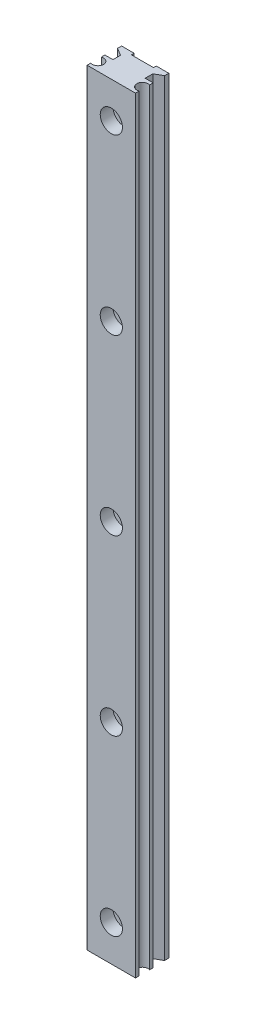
ISO-10303-21;
HEADER;
FILE_DESCRIPTION(('STEP AP214'),'2;1');
FILE_NAME('part.step','',(''),(''),'','','');
FILE_SCHEMA(('AUTOMOTIVE_DESIGN { 1 0 10303 214 1 1 1 1 }'));
ENDSEC;
DATA;
#1=APPLICATION_CONTEXT('core data for automotive mechanical design processes');
#2=APPLICATION_PROTOCOL_DEFINITION('international standard','automotive_design',2000,#1);
#3=PRODUCT_CONTEXT('',#1,'mechanical');
#4=PRODUCT('Part','Part','',(#3));
#5=PRODUCT_RELATED_PRODUCT_CATEGORY('part','',(#4));
#6=PRODUCT_DEFINITION_FORMATION('','',#4);
#7=PRODUCT_DEFINITION_CONTEXT('part definition',#1,'design');
#8=PRODUCT_DEFINITION('design','',#6,#7);
#9=PRODUCT_DEFINITION_SHAPE('','',#8);
#10=(LENGTH_UNIT() NAMED_UNIT(*) SI_UNIT(.MILLI.,.METRE.));
#11=(NAMED_UNIT(*) PLANE_ANGLE_UNIT() SI_UNIT($,.RADIAN.));
#12=(NAMED_UNIT(*) SI_UNIT($,.STERADIAN.) SOLID_ANGLE_UNIT());
#13=UNCERTAINTY_MEASURE_WITH_UNIT(LENGTH_MEASURE(1.E-05),#10,'distance_accuracy_value','');
#14=(GEOMETRIC_REPRESENTATION_CONTEXT(3) GLOBAL_UNCERTAINTY_ASSIGNED_CONTEXT((#13)) GLOBAL_UNIT_ASSIGNED_CONTEXT((#10,
#11,#12)) REPRESENTATION_CONTEXT('',''));
#15=CARTESIAN_POINT('',(0.,0.,0.));
#16=DIRECTION('',(0.,0.,1.));
#17=DIRECTION('',(1.,0.,0.));
#18=AXIS2_PLACEMENT_3D('',#15,#16,#17);
#19=CARTESIAN_POINT('',(0.,263.,4.3));
#20=DIRECTION('',(0.,0.,1.));
#21=DIRECTION('',(0.,-1.,0.));
#22=AXIS2_PLACEMENT_3D('',#19,#20,#21);
#23=CYLINDRICAL_SURFACE('',#22,2.25);
#24=CARTESIAN_POINT('',(0.,263.,0.999999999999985));
#25=DIRECTION('',(0.,0.,1.));
#26=DIRECTION('',(0.,-1.,0.));
#27=AXIS2_PLACEMENT_3D('',#24,#25,#26);
#28=CIRCLE('',#27,2.25);
#29=CARTESIAN_POINT('',(0.,260.75,0.999999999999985));
#30=VERTEX_POINT('',#29);
#31=EDGE_CURVE('E263',#30,#30,#28,.T.);
#32=ORIENTED_EDGE('',*,*,#31,.F.);
#33=EDGE_LOOP('',(#32));
#34=FACE_BOUND('',#33,.T.);
#35=CARTESIAN_POINT('',(0.,263.,7.6));
#36=DIRECTION('',(0.,0.,1.));
#37=DIRECTION('',(0.,-1.,0.));
#38=AXIS2_PLACEMENT_3D('',#35,#36,#37);
#39=CIRCLE('',#38,2.25);
#40=CARTESIAN_POINT('',(0.,260.75,7.6));
#41=VERTEX_POINT('',#40);
#42=EDGE_CURVE('E19',#41,#41,#39,.T.);
#43=ORIENTED_EDGE('',*,*,#42,.T.);
#44=EDGE_LOOP('',(#43));
#45=FACE_BOUND('',#44,.T.);
#46=ADVANCED_FACE('F16',(#34,#45),#23,.F.);
#47=CARTESIAN_POINT('',(0.,200.5,4.3));
#48=DIRECTION('',(0.,0.,1.));
#49=DIRECTION('',(0.,-1.,0.));
#50=AXIS2_PLACEMENT_3D('',#47,#48,#49);
#51=CYLINDRICAL_SURFACE('',#50,2.25);
#52=CARTESIAN_POINT('',(0.,200.5,0.999999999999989));
#53=DIRECTION('',(0.,0.,1.));
#54=DIRECTION('',(0.,-1.,0.));
#55=AXIS2_PLACEMENT_3D('',#52,#53,#54);
#56=CIRCLE('',#55,2.25);
#57=CARTESIAN_POINT('',(0.,198.25,0.999999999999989));
#58=VERTEX_POINT('',#57);
#59=EDGE_CURVE('E396',#58,#58,#56,.T.);
#60=ORIENTED_EDGE('',*,*,#59,.F.);
#61=EDGE_LOOP('',(#60));
#62=FACE_BOUND('',#61,.T.);
#63=CARTESIAN_POINT('',(0.,200.5,7.6));
#64=DIRECTION('',(0.,0.,1.));
#65=DIRECTION('',(0.,-1.,0.));
#66=AXIS2_PLACEMENT_3D('',#63,#64,#65);
#67=CIRCLE('',#66,2.25);
#68=CARTESIAN_POINT('',(0.,198.25,7.6));
#69=VERTEX_POINT('',#68);
#70=EDGE_CURVE('E408',#69,#69,#67,.T.);
#71=ORIENTED_EDGE('',*,*,#70,.T.);
#72=EDGE_LOOP('',(#71));
#73=FACE_BOUND('',#72,.T.);
#74=ADVANCED_FACE('F527',(#62,#73),#51,.F.);
#75=CARTESIAN_POINT('',(0.,138.,4.3));
#76=DIRECTION('',(0.,0.,1.));
#77=DIRECTION('',(0.,-1.,0.));
#78=AXIS2_PLACEMENT_3D('',#75,#76,#77);
#79=CYLINDRICAL_SURFACE('',#78,2.25);
#80=CARTESIAN_POINT('',(0.,138.,0.999999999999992));
#81=DIRECTION('',(0.,0.,1.));
#82=DIRECTION('',(0.,-1.,0.));
#83=AXIS2_PLACEMENT_3D('',#80,#81,#82);
#84=CIRCLE('',#83,2.25);
#85=CARTESIAN_POINT('',(0.,135.75,0.999999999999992));
#86=VERTEX_POINT('',#85);
#87=EDGE_CURVE('E393',#86,#86,#84,.T.);
#88=ORIENTED_EDGE('',*,*,#87,.F.);
#89=EDGE_LOOP('',(#88));
#90=FACE_BOUND('',#89,.T.);
#91=CARTESIAN_POINT('',(0.,138.,7.6));
#92=DIRECTION('',(0.,0.,1.));
#93=DIRECTION('',(0.,-1.,0.));
#94=AXIS2_PLACEMENT_3D('',#91,#92,#93);
#95=CIRCLE('',#94,2.25);
#96=CARTESIAN_POINT('',(0.,135.75,7.6));
#97=VERTEX_POINT('',#96);
#98=EDGE_CURVE('E406',#97,#97,#95,.T.);
#99=ORIENTED_EDGE('',*,*,#98,.T.);
#100=EDGE_LOOP('',(#99));
#101=FACE_BOUND('',#100,.T.);
#102=ADVANCED_FACE('F524',(#90,#101),#79,.F.);
#103=CARTESIAN_POINT('',(0.,75.5,4.3));
#104=DIRECTION('',(0.,0.,1.));
#105=DIRECTION('',(0.,-1.,0.));
#106=AXIS2_PLACEMENT_3D('',#103,#104,#105);
#107=CYLINDRICAL_SURFACE('',#106,2.25);
#108=CARTESIAN_POINT('',(0.,75.5,0.999999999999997));
#109=DIRECTION('',(0.,0.,1.));
#110=DIRECTION('',(0.,-1.,0.));
#111=AXIS2_PLACEMENT_3D('',#108,#109,#110);
#112=CIRCLE('',#111,2.25);
#113=CARTESIAN_POINT('',(0.,73.25,0.999999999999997));
#114=VERTEX_POINT('',#113);
#115=EDGE_CURVE('E390',#114,#114,#112,.T.);
#116=ORIENTED_EDGE('',*,*,#115,.F.);
#117=EDGE_LOOP('',(#116));
#118=FACE_BOUND('',#117,.T.);
#119=CARTESIAN_POINT('',(0.,75.5,7.6));
#120=DIRECTION('',(0.,0.,1.));
#121=DIRECTION('',(0.,-1.,0.));
#122=AXIS2_PLACEMENT_3D('',#119,#120,#121);
#123=CIRCLE('',#122,2.25);
#124=CARTESIAN_POINT('',(0.,73.25,7.6));
#125=VERTEX_POINT('',#124);
#126=EDGE_CURVE('E403',#125,#125,#123,.T.);
#127=ORIENTED_EDGE('',*,*,#126,.T.);
#128=EDGE_LOOP('',(#127));
#129=FACE_BOUND('',#128,.T.);
#130=ADVANCED_FACE('F520',(#118,#129),#107,.F.);
#131=CARTESIAN_POINT('',(0.,13.,4.3));
#132=DIRECTION('',(0.,0.,1.));
#133=DIRECTION('',(0.,-1.,0.));
#134=AXIS2_PLACEMENT_3D('',#131,#132,#133);
#135=CYLINDRICAL_SURFACE('',#134,2.25);
#136=CARTESIAN_POINT('',(0.,13.,1.));
#137=DIRECTION('',(0.,0.,1.));
#138=DIRECTION('',(0.,-1.,0.));
#139=AXIS2_PLACEMENT_3D('',#136,#137,#138);
#140=CIRCLE('',#139,2.25);
#141=CARTESIAN_POINT('',(0.,10.75,1.));
#142=VERTEX_POINT('',#141);
#143=EDGE_CURVE('E259',#142,#142,#140,.T.);
#144=ORIENTED_EDGE('',*,*,#143,.F.);
#145=EDGE_LOOP('',(#144));
#146=FACE_BOUND('',#145,.T.);
#147=CARTESIAN_POINT('',(0.,13.,7.6));
#148=DIRECTION('',(0.,0.,1.));
#149=DIRECTION('',(0.,-1.,0.));
#150=AXIS2_PLACEMENT_3D('',#147,#148,#149);
#151=CIRCLE('',#150,2.25);
#152=CARTESIAN_POINT('',(0.,10.75,7.6));
#153=VERTEX_POINT('',#152);
#154=EDGE_CURVE('E290',#153,#153,#151,.T.);
#155=ORIENTED_EDGE('',*,*,#154,.T.);
#156=EDGE_LOOP('',(#155));
#157=FACE_BOUND('',#156,.T.);
#158=ADVANCED_FACE('F516',(#146,#157),#135,.F.);
#159=CARTESIAN_POINT('',(-4.,0.,0.5));
#160=DIRECTION('',(1.,0.,0.));
#161=DIRECTION('',(0.,0.,-1.));
#162=AXIS2_PLACEMENT_3D('',#159,#160,#161);
#163=PLANE('',#162);
#164=DIRECTION('',(0.,0.,-1.));
#165=VECTOR('',#164,1.);
#166=CARTESIAN_POINT('',(-4.,0.,0.5));
#167=LINE('',#166,#165);
#168=CARTESIAN_POINT('',(-4.,0.,0.999999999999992));
#169=VERTEX_POINT('',#168);
#170=CARTESIAN_POINT('',(-4.,0.,0.));
#171=VERTEX_POINT('',#170);
#172=EDGE_CURVE('E315',#169,#171,#167,.T.);
#173=ORIENTED_EDGE('',*,*,#172,.T.);
#174=DIRECTION('',(0.,1.,0.));
#175=VECTOR('',#174,1.);
#176=CARTESIAN_POINT('',(-4.,0.,0.));
#177=LINE('',#176,#175);
#178=CARTESIAN_POINT('',(-4.,276.,0.));
#179=VERTEX_POINT('',#178);
#180=EDGE_CURVE('E264',#179,#171,#177,.F.);
#181=ORIENTED_EDGE('',*,*,#180,.F.);
#182=DIRECTION('',(0.,0.,-1.));
#183=VECTOR('',#182,1.);
#184=CARTESIAN_POINT('',(-4.,276.,0.5));
#185=LINE('',#184,#183);
#186=CARTESIAN_POINT('',(-4.,276.,0.999999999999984));
#187=VERTEX_POINT('',#186);
#188=EDGE_CURVE('E317',#179,#187,#185,.F.);
#189=ORIENTED_EDGE('',*,*,#188,.T.);
#190=DIRECTION('',(0.,1.,0.));
#191=VECTOR('',#190,1.);
#192=CARTESIAN_POINT('',(-4.,0.,1.));
#193=LINE('',#192,#191);
#194=EDGE_CURVE('E253',#169,#187,#193,.T.);
#195=ORIENTED_EDGE('',*,*,#194,.F.);
#196=EDGE_LOOP('',(#173,#181,#189,#195));
#197=FACE_BOUND('',#196,.T.);
#198=ADVANCED_FACE('F512',(#197),#163,.T.);
#199=CARTESIAN_POINT('',(4.,0.,0.500000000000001));
#200=DIRECTION('',(-1.,0.,0.));
#201=DIRECTION('',(0.,0.,1.));
#202=AXIS2_PLACEMENT_3D('',#199,#200,#201);
#203=PLANE('',#202);
#204=DIRECTION('',(0.,0.,1.));
#205=VECTOR('',#204,1.);
#206=CARTESIAN_POINT('',(4.,0.,0.500000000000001));
#207=LINE('',#206,#205);
#208=CARTESIAN_POINT('',(4.,0.,0.));
#209=VERTEX_POINT('',#208);
#210=CARTESIAN_POINT('',(4.,0.,1.));
#211=VERTEX_POINT('',#210);
#212=EDGE_CURVE('E311',#209,#211,#207,.T.);
#213=ORIENTED_EDGE('',*,*,#212,.T.);
#214=DIRECTION('',(0.,1.,0.));
#215=VECTOR('',#214,1.);
#216=CARTESIAN_POINT('',(4.,0.,1.));
#217=LINE('',#216,#215);
#218=CARTESIAN_POINT('',(4.,276.,0.999999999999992));
#219=VERTEX_POINT('',#218);
#220=EDGE_CURVE('E256',#219,#211,#217,.F.);
#221=ORIENTED_EDGE('',*,*,#220,.F.);
#222=DIRECTION('',(0.,0.,1.));
#223=VECTOR('',#222,1.);
#224=CARTESIAN_POINT('',(4.,276.,0.500000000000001));
#225=LINE('',#224,#223);
#226=CARTESIAN_POINT('',(4.,276.,0.));
#227=VERTEX_POINT('',#226);
#228=EDGE_CURVE('E313',#219,#227,#225,.F.);
#229=ORIENTED_EDGE('',*,*,#228,.T.);
#230=DIRECTION('',(0.,1.,0.));
#231=VECTOR('',#230,1.);
#232=CARTESIAN_POINT('',(4.,0.,0.));
#233=LINE('',#232,#231);
#234=EDGE_CURVE('E247',#209,#227,#233,.T.);
#235=ORIENTED_EDGE('',*,*,#234,.F.);
#236=EDGE_LOOP('',(#213,#221,#229,#235));
#237=FACE_BOUND('',#236,.T.);
#238=ADVANCED_FACE('F508',(#237),#203,.T.);
#239=CARTESIAN_POINT('',(8.5,0.,0.750000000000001));
#240=DIRECTION('',(1.,0.,0.));
#241=DIRECTION('',(0.,0.,-1.));
#242=AXIS2_PLACEMENT_3D('',#239,#240,#241);
#243=PLANE('',#242);
#244=DIRECTION('',(0.,0.,-1.));
#245=VECTOR('',#244,1.);
#246=CARTESIAN_POINT('',(8.5,0.,0.750000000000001));
#247=LINE('',#246,#245);
#248=CARTESIAN_POINT('',(8.5,0.,1.49999999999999));
#249=VERTEX_POINT('',#248);
#250=CARTESIAN_POINT('',(8.5,0.,0.));
#251=VERTEX_POINT('',#250);
#252=EDGE_CURVE('E305',#249,#251,#247,.T.);
#253=ORIENTED_EDGE('',*,*,#252,.T.);
#254=DIRECTION('',(0.,1.,0.));
#255=VECTOR('',#254,1.);
#256=CARTESIAN_POINT('',(8.5,0.,0.));
#257=LINE('',#256,#255);
#258=CARTESIAN_POINT('',(8.5,276.,0.));
#259=VERTEX_POINT('',#258);
#260=EDGE_CURVE('E250',#259,#251,#257,.F.);
#261=ORIENTED_EDGE('',*,*,#260,.F.);
#262=DIRECTION('',(0.,0.,-1.));
#263=VECTOR('',#262,1.);
#264=CARTESIAN_POINT('',(8.5,276.,0.750000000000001));
#265=LINE('',#264,#263);
#266=CARTESIAN_POINT('',(8.5,276.,1.49999999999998));
#267=VERTEX_POINT('',#266);
#268=EDGE_CURVE('E309',#259,#267,#265,.F.);
#269=ORIENTED_EDGE('',*,*,#268,.T.);
#270=DIRECTION('',(0.,1.,0.));
#271=VECTOR('',#270,1.);
#272=CARTESIAN_POINT('',(8.5,0.,1.5));
#273=LINE('',#272,#271);
#274=EDGE_CURVE('E244',#249,#267,#273,.T.);
#275=ORIENTED_EDGE('',*,*,#274,.F.);
#276=EDGE_LOOP('',(#253,#261,#269,#275));
#277=FACE_BOUND('',#276,.T.);
#278=ADVANCED_FACE('F505',(#277),#243,.T.);
#279=CARTESIAN_POINT('',(8.7,0.,6.4682503));
#280=DIRECTION('',(1.,0.,0.));
#281=DIRECTION('',(0.,1.,0.));
#282=AXIS2_PLACEMENT_3D('',#279,#280,#281);
#283=PLANE('',#282);
#284=DIRECTION('',(0.,0.,1.));
#285=VECTOR('',#284,1.);
#286=CARTESIAN_POINT('',(8.7,0.,6.4682503));
#287=LINE('',#286,#285);
#288=CARTESIAN_POINT('',(8.7,0.,7.1265006));
#289=VERTEX_POINT('',#288);
#290=CARTESIAN_POINT('',(8.7,0.,5.81));
#291=VERTEX_POINT('',#290);
#292=EDGE_CURVE('E295',#289,#291,#287,.F.);
#293=ORIENTED_EDGE('',*,*,#292,.T.);
#294=DIRECTION('',(0.,1.,0.));
#295=VECTOR('',#294,1.);
#296=CARTESIAN_POINT('',(8.7,0.,5.81));
#297=LINE('',#296,#295);
#298=CARTESIAN_POINT('',(8.7,276.,5.80999999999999));
#299=VERTEX_POINT('',#298);
#300=EDGE_CURVE('E240',#299,#291,#297,.F.);
#301=ORIENTED_EDGE('',*,*,#300,.F.);
#302=DIRECTION('',(0.,0.,1.));
#303=VECTOR('',#302,1.);
#304=CARTESIAN_POINT('',(8.7,276.,6.4682503));
#305=LINE('',#304,#303);
#306=CARTESIAN_POINT('',(8.7,276.,7.12650059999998));
#307=VERTEX_POINT('',#306);
#308=EDGE_CURVE('E162',#299,#307,#305,.T.);
#309=ORIENTED_EDGE('',*,*,#308,.T.);
#310=DIRECTION('',(0.,1.,0.));
#311=VECTOR('',#310,1.);
#312=CARTESIAN_POINT('',(8.7,0.,7.1265006));
#313=LINE('',#312,#311);
#314=EDGE_CURVE('E173',#289,#307,#313,.T.);
#315=ORIENTED_EDGE('',*,*,#314,.F.);
#316=EDGE_LOOP('',(#293,#301,#309,#315));
#317=FACE_BOUND('',#316,.T.);
#318=ADVANCED_FACE('F501',(#317),#283,.T.);
#319=CARTESIAN_POINT('',(-8.7,0.,6.4682503));
#320=DIRECTION('',(-1.,0.,0.));
#321=DIRECTION('',(0.,0.,1.));
#322=AXIS2_PLACEMENT_3D('',#319,#320,#321);
#323=PLANE('',#322);
#324=DIRECTION('',(0.,0.,1.));
#325=VECTOR('',#324,1.);
#326=CARTESIAN_POINT('',(-8.7,0.,6.4682503));
#327=LINE('',#326,#325);
#328=CARTESIAN_POINT('',(-8.7,0.,5.80999999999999));
#329=VERTEX_POINT('',#328);
#330=CARTESIAN_POINT('',(-8.7,0.,7.1265006));
#331=VERTEX_POINT('',#330);
#332=EDGE_CURVE('E288',#329,#331,#327,.T.);
#333=ORIENTED_EDGE('',*,*,#332,.T.);
#334=DIRECTION('',(0.,1.,0.));
#335=VECTOR('',#334,1.);
#336=CARTESIAN_POINT('',(-8.7,0.,7.1265006));
#337=LINE('',#336,#335);
#338=CARTESIAN_POINT('',(-8.7,276.,7.12650059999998));
#339=VERTEX_POINT('',#338);
#340=EDGE_CURVE('E222',#339,#331,#337,.F.);
#341=ORIENTED_EDGE('',*,*,#340,.F.);
#342=DIRECTION('',(0.,0.,1.));
#343=VECTOR('',#342,1.);
#344=CARTESIAN_POINT('',(-8.7,276.,6.4682503));
#345=LINE('',#344,#343);
#346=CARTESIAN_POINT('',(-8.7,276.,5.80999999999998));
#347=VERTEX_POINT('',#346);
#348=EDGE_CURVE('E293',#339,#347,#345,.F.);
#349=ORIENTED_EDGE('',*,*,#348,.T.);
#350=DIRECTION('',(0.,1.,0.));
#351=VECTOR('',#350,1.);
#352=CARTESIAN_POINT('',(-8.7,0.,5.81));
#353=LINE('',#352,#351);
#354=EDGE_CURVE('E221',#329,#347,#353,.T.);
#355=ORIENTED_EDGE('',*,*,#354,.F.);
#356=EDGE_LOOP('',(#333,#341,#349,#355));
#357=FACE_BOUND('',#356,.T.);
#358=ADVANCED_FACE('F497',(#357),#323,.T.);
#359=CARTESIAN_POINT('',(-8.5,0.,0.75));
#360=DIRECTION('',(-1.,0.,0.));
#361=DIRECTION('',(0.,0.,1.));
#362=AXIS2_PLACEMENT_3D('',#359,#360,#361);
#363=PLANE('',#362);
#364=DIRECTION('',(0.,0.,1.));
#365=VECTOR('',#364,1.);
#366=CARTESIAN_POINT('',(-8.5,0.,0.75));
#367=LINE('',#366,#365);
#368=CARTESIAN_POINT('',(-8.5,0.,0.));
#369=VERTEX_POINT('',#368);
#370=CARTESIAN_POINT('',(-8.5,0.,1.5));
#371=VERTEX_POINT('',#370);
#372=EDGE_CURVE('E284',#369,#371,#367,.T.);
#373=ORIENTED_EDGE('',*,*,#372,.T.);
#374=DIRECTION('',(0.,1.,0.));
#375=VECTOR('',#374,1.);
#376=CARTESIAN_POINT('',(-8.50000000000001,0.,1.5));
#377=LINE('',#376,#375);
#378=CARTESIAN_POINT('',(-8.5,276.,1.49999999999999));
#379=VERTEX_POINT('',#378);
#380=EDGE_CURVE('E215',#379,#371,#377,.F.);
#381=ORIENTED_EDGE('',*,*,#380,.F.);
#382=DIRECTION('',(0.,0.,1.));
#383=VECTOR('',#382,1.);
#384=CARTESIAN_POINT('',(-8.5,276.,0.75));
#385=LINE('',#384,#383);
#386=CARTESIAN_POINT('',(-8.5,276.,0.));
#387=VERTEX_POINT('',#386);
#388=EDGE_CURVE('E286',#379,#387,#385,.F.);
#389=ORIENTED_EDGE('',*,*,#388,.T.);
#390=DIRECTION('',(0.,1.,0.));
#391=VECTOR('',#390,1.);
#392=CARTESIAN_POINT('',(-8.5,0.,0.));
#393=LINE('',#392,#391);
#394=EDGE_CURVE('E260',#369,#387,#393,.T.);
#395=ORIENTED_EDGE('',*,*,#394,.F.);
#396=EDGE_LOOP('',(#373,#381,#389,#395));
#397=FACE_BOUND('',#396,.T.);
#398=ADVANCED_FACE('F420',(#397),#363,.T.);
#399=CARTESIAN_POINT('',(3.125,263.,7.6));
#400=DIRECTION('',(0.,0.,-1.));
#401=DIRECTION('',(0.,1.,0.));
#402=AXIS2_PLACEMENT_3D('',#399,#400,#401);
#403=PLANE('',#402);
#404=ORIENTED_EDGE('',*,*,#42,.F.);
#405=EDGE_LOOP('',(#404));
#406=FACE_BOUND('',#405,.T.);
#407=CARTESIAN_POINT('',(0.,263.,7.6));
#408=DIRECTION('',(0.,0.,1.));
#409=DIRECTION('',(0.,-1.,0.));
#410=AXIS2_PLACEMENT_3D('',#407,#408,#409);
#411=CIRCLE('',#410,4.);
#412=CARTESIAN_POINT('',(0.,259.,7.6));
#413=VERTEX_POINT('',#412);
#414=EDGE_CURVE('E185',#413,#413,#411,.T.);
#415=ORIENTED_EDGE('',*,*,#414,.T.);
#416=EDGE_LOOP('',(#415));
#417=FACE_BOUND('',#416,.T.);
#418=ADVANCED_FACE('F416',(#406,#417),#403,.F.);
#419=CARTESIAN_POINT('',(3.125,200.5,7.6));
#420=DIRECTION('',(0.,0.,-1.));
#421=DIRECTION('',(0.,1.,0.));
#422=AXIS2_PLACEMENT_3D('',#419,#420,#421);
#423=PLANE('',#422);
#424=ORIENTED_EDGE('',*,*,#70,.F.);
#425=EDGE_LOOP('',(#424));
#426=FACE_BOUND('',#425,.T.);
#427=CARTESIAN_POINT('',(0.,200.5,7.6));
#428=DIRECTION('',(0.,0.,1.));
#429=DIRECTION('',(0.,-1.,0.));
#430=AXIS2_PLACEMENT_3D('',#427,#428,#429);
#431=CIRCLE('',#430,4.);
#432=CARTESIAN_POINT('',(0.,196.5,7.6));
#433=VERTEX_POINT('',#432);
#434=EDGE_CURVE('E383',#433,#433,#431,.T.);
#435=ORIENTED_EDGE('',*,*,#434,.T.);
#436=EDGE_LOOP('',(#435));
#437=FACE_BOUND('',#436,.T.);
#438=ADVANCED_FACE('F419',(#426,#437),#423,.F.);
#439=CARTESIAN_POINT('',(3.125,138.,7.6));
#440=DIRECTION('',(0.,0.,-1.));
#441=DIRECTION('',(0.,1.,0.));
#442=AXIS2_PLACEMENT_3D('',#439,#440,#441);
#443=PLANE('',#442);
#444=ORIENTED_EDGE('',*,*,#98,.F.);
#445=EDGE_LOOP('',(#444));
#446=FACE_BOUND('',#445,.T.);
#447=CARTESIAN_POINT('',(0.,138.,7.6));
#448=DIRECTION('',(0.,0.,1.));
#449=DIRECTION('',(0.,-1.,0.));
#450=AXIS2_PLACEMENT_3D('',#447,#448,#449);
#451=CIRCLE('',#450,4.);
#452=CARTESIAN_POINT('',(0.,134.,7.6));
#453=VERTEX_POINT('',#452);
#454=EDGE_CURVE('E380',#453,#453,#451,.T.);
#455=ORIENTED_EDGE('',*,*,#454,.T.);
#456=EDGE_LOOP('',(#455));
#457=FACE_BOUND('',#456,.T.);
#458=ADVANCED_FACE('F478',(#446,#457),#443,.F.);
#459=CARTESIAN_POINT('',(3.125,75.5,7.6));
#460=DIRECTION('',(0.,0.,-1.));
#461=DIRECTION('',(0.,1.,0.));
#462=AXIS2_PLACEMENT_3D('',#459,#460,#461);
#463=PLANE('',#462);
#464=ORIENTED_EDGE('',*,*,#126,.F.);
#465=EDGE_LOOP('',(#464));
#466=FACE_BOUND('',#465,.T.);
#467=CARTESIAN_POINT('',(0.,75.5,7.6));
#468=DIRECTION('',(0.,0.,1.));
#469=DIRECTION('',(0.,-1.,0.));
#470=AXIS2_PLACEMENT_3D('',#467,#468,#469);
#471=CIRCLE('',#470,4.);
#472=CARTESIAN_POINT('',(0.,71.5,7.6));
#473=VERTEX_POINT('',#472);
#474=EDGE_CURVE('E377',#473,#473,#471,.T.);
#475=ORIENTED_EDGE('',*,*,#474,.T.);
#476=EDGE_LOOP('',(#475));
#477=FACE_BOUND('',#476,.T.);
#478=ADVANCED_FACE('F480',(#466,#477),#463,.F.);
#479=CARTESIAN_POINT('',(3.125,13.,7.6));
#480=DIRECTION('',(0.,0.,-1.));
#481=DIRECTION('',(0.,1.,0.));
#482=AXIS2_PLACEMENT_3D('',#479,#480,#481);
#483=PLANE('',#482);
#484=ORIENTED_EDGE('',*,*,#154,.F.);
#485=EDGE_LOOP('',(#484));
#486=FACE_BOUND('',#485,.T.);
#487=CARTESIAN_POINT('',(0.,13.,7.6));
#488=DIRECTION('',(0.,0.,1.));
#489=DIRECTION('',(0.,-1.,0.));
#490=AXIS2_PLACEMENT_3D('',#487,#488,#489);
#491=CIRCLE('',#490,4.);
#492=CARTESIAN_POINT('',(0.,9.,7.6));
#493=VERTEX_POINT('',#492);
#494=EDGE_CURVE('E212',#493,#493,#491,.T.);
#495=ORIENTED_EDGE('',*,*,#494,.T.);
#496=EDGE_LOOP('',(#495));
#497=FACE_BOUND('',#496,.T.);
#498=ADVANCED_FACE('F487',(#486,#497),#483,.F.);
#499=CARTESIAN_POINT('',(-8.7,0.,11.5317497));
#500=DIRECTION('',(-1.,0.,0.));
#501=DIRECTION('',(0.,0.,1.));
#502=AXIS2_PLACEMENT_3D('',#499,#500,#501);
#503=PLANE('',#502);
#504=DIRECTION('',(0.,0.,1.));
#505=VECTOR('',#504,1.);
#506=CARTESIAN_POINT('',(-8.7,0.,11.5317497));
#507=LINE('',#506,#505);
#508=CARTESIAN_POINT('',(-8.7,0.,10.8734994));
#509=VERTEX_POINT('',#508);
#510=CARTESIAN_POINT('',(-8.7,0.,12.19));
#511=VERTEX_POINT('',#510);
#512=EDGE_CURVE('E267',#509,#511,#507,.T.);
#513=ORIENTED_EDGE('',*,*,#512,.T.);
#514=DIRECTION('',(0.,1.,0.));
#515=VECTOR('',#514,1.);
#516=CARTESIAN_POINT('',(-8.7,0.,12.19));
#517=LINE('',#516,#515);
#518=CARTESIAN_POINT('',(-8.7,276.,12.19));
#519=VERTEX_POINT('',#518);
#520=EDGE_CURVE('E268',#519,#511,#517,.F.);
#521=ORIENTED_EDGE('',*,*,#520,.F.);
#522=DIRECTION('',(0.,0.,-1.));
#523=VECTOR('',#522,1.);
#524=CARTESIAN_POINT('',(-8.7,276.,6.21001012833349));
#525=LINE('',#524,#523);
#526=CARTESIAN_POINT('',(-8.7,276.,10.8734994));
#527=VERTEX_POINT('',#526);
#528=EDGE_CURVE('E193',#519,#527,#525,.T.);
#529=ORIENTED_EDGE('',*,*,#528,.T.);
#530=DIRECTION('',(0.,1.,0.));
#531=VECTOR('',#530,1.);
#532=CARTESIAN_POINT('',(-8.7,0.,10.8734994));
#533=LINE('',#532,#531);
#534=EDGE_CURVE('E225',#509,#527,#533,.T.);
#535=ORIENTED_EDGE('',*,*,#534,.F.);
#536=EDGE_LOOP('',(#513,#521,#529,#535));
#537=FACE_BOUND('',#536,.T.);
#538=ADVANCED_FACE('F552',(#537),#503,.T.);
#539=CARTESIAN_POINT('',(-6.25,0.,0.));
#540=DIRECTION('',(0.,0.,-1.));
#541=DIRECTION('',(0.,1.,0.));
#542=AXIS2_PLACEMENT_3D('',#539,#540,#541);
#543=PLANE('',#542);
#544=DIRECTION('',(1.,0.,0.));
#545=VECTOR('',#544,1.);
#546=CARTESIAN_POINT('',(0.,0.,0.));
#547=LINE('',#546,#545);
#548=EDGE_CURVE('E271',#369,#171,#547,.T.);
#549=ORIENTED_EDGE('',*,*,#548,.F.);
#550=ORIENTED_EDGE('',*,*,#394,.T.);
#551=DIRECTION('',(1.,0.,0.));
#552=VECTOR('',#551,1.);
#553=CARTESIAN_POINT('',(0.,276.,0.));
#554=LINE('',#553,#552);
#555=EDGE_CURVE('E277',#387,#179,#554,.T.);
#556=ORIENTED_EDGE('',*,*,#555,.T.);
#557=ORIENTED_EDGE('',*,*,#180,.T.);
#558=EDGE_LOOP('',(#549,#550,#556,#557));
#559=FACE_BOUND('',#558,.T.);
#560=ADVANCED_FACE('F541',(#559),#543,.T.);
#561=CARTESIAN_POINT('',(0.,0.,1.));
#562=DIRECTION('',(0.,0.,-1.));
#563=DIRECTION('',(0.,1.,0.));
#564=AXIS2_PLACEMENT_3D('',#561,#562,#563);
#565=PLANE('',#564);
#566=DIRECTION('',(1.,0.,0.));
#567=VECTOR('',#566,1.);
#568=CARTESIAN_POINT('',(0.,0.,1.));
#569=LINE('',#568,#567);
#570=EDGE_CURVE('E928',#169,#211,#569,.T.);
#571=ORIENTED_EDGE('',*,*,#570,.F.);
#572=ORIENTED_EDGE('',*,*,#194,.T.);
#573=DIRECTION('',(1.,0.,0.));
#574=VECTOR('',#573,1.);
#575=CARTESIAN_POINT('',(0.,276.,0.999999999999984));
#576=LINE('',#575,#574);
#577=EDGE_CURVE('E209',#187,#219,#576,.T.);
#578=ORIENTED_EDGE('',*,*,#577,.T.);
#579=ORIENTED_EDGE('',*,*,#220,.T.);
#580=EDGE_LOOP('',(#571,#572,#578,#579));
#581=FACE_BOUND('',#580,.T.);
#582=ORIENTED_EDGE('',*,*,#143,.T.);
#583=EDGE_LOOP('',(#582));
#584=FACE_BOUND('',#583,.T.);
#585=ORIENTED_EDGE('',*,*,#115,.T.);
#586=EDGE_LOOP('',(#585));
#587=FACE_BOUND('',#586,.T.);
#588=ORIENTED_EDGE('',*,*,#87,.T.);
#589=EDGE_LOOP('',(#588));
#590=FACE_BOUND('',#589,.T.);
#591=ORIENTED_EDGE('',*,*,#59,.T.);
#592=EDGE_LOOP('',(#591));
#593=FACE_BOUND('',#592,.T.);
#594=ORIENTED_EDGE('',*,*,#31,.T.);
#595=EDGE_LOOP('',(#594));
#596=FACE_BOUND('',#595,.T.);
#597=ADVANCED_FACE('F537',(#581,#584,#587,#590,#593,#596),#565,.T.);
#598=CARTESIAN_POINT('',(6.25,0.,0.));
#599=DIRECTION('',(0.,0.,-1.));
#600=DIRECTION('',(0.,1.,0.));
#601=AXIS2_PLACEMENT_3D('',#598,#599,#600);
#602=PLANE('',#601);
#603=DIRECTION('',(1.,0.,0.));
#604=VECTOR('',#603,1.);
#605=CARTESIAN_POINT('',(0.,0.,0.));
#606=LINE('',#605,#604);
#607=EDGE_CURVE('E925',#209,#251,#606,.T.);
#608=ORIENTED_EDGE('',*,*,#607,.F.);
#609=ORIENTED_EDGE('',*,*,#234,.T.);
#610=DIRECTION('',(1.,0.,0.));
#611=VECTOR('',#610,1.);
#612=CARTESIAN_POINT('',(0.,276.,0.));
#613=LINE('',#612,#611);
#614=EDGE_CURVE('E206',#227,#259,#613,.T.);
#615=ORIENTED_EDGE('',*,*,#614,.T.);
#616=ORIENTED_EDGE('',*,*,#260,.T.);
#617=EDGE_LOOP('',(#608,#609,#615,#616));
#618=FACE_BOUND('',#617,.T.);
#619=ADVANCED_FACE('F540',(#618),#602,.T.);
#620=CARTESIAN_POINT('',(7.15,0.,2.279422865));
#621=DIRECTION('',(0.500000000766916,0.,0.86602540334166));
#622=DIRECTION('',(0.86602540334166,0.,-0.500000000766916));
#623=AXIS2_PLACEMENT_3D('',#620,#621,#622);
#624=PLANE('',#623);
#625=DIRECTION('',(-0.86602540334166,0.,0.500000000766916));
#626=VECTOR('',#625,1.);
#627=CARTESIAN_POINT('',(8.5,0.,1.5));
#628=LINE('',#627,#626);
#629=CARTESIAN_POINT('',(5.8,0.,3.05884573));
#630=VERTEX_POINT('',#629);
#631=EDGE_CURVE('E922',#249,#630,#628,.T.);
#632=ORIENTED_EDGE('',*,*,#631,.F.);
#633=ORIENTED_EDGE('',*,*,#274,.T.);
#634=DIRECTION('',(-0.86602540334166,0.,0.500000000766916));
#635=VECTOR('',#634,1.);
#636=CARTESIAN_POINT('',(8.5,276.,1.49999999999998));
#637=LINE('',#636,#635);
#638=CARTESIAN_POINT('',(5.8,276.,3.05884572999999));
#639=VERTEX_POINT('',#638);
#640=EDGE_CURVE('E204',#267,#639,#637,.T.);
#641=ORIENTED_EDGE('',*,*,#640,.T.);
#642=DIRECTION('',(0.,1.,0.));
#643=VECTOR('',#642,1.);
#644=CARTESIAN_POINT('',(5.8,0.,3.05884573));
#645=LINE('',#644,#643);
#646=EDGE_CURVE('E241',#630,#639,#645,.T.);
#647=ORIENTED_EDGE('',*,*,#646,.F.);
#648=EDGE_LOOP('',(#632,#633,#641,#647));
#649=FACE_BOUND('',#648,.T.);
#650=ADVANCED_FACE('F549',(#649),#624,.T.);
#651=CARTESIAN_POINT('',(5.8,0.,4.434422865));
#652=DIRECTION('',(1.,0.,0.));
#653=DIRECTION('',(0.,0.,-1.));
#654=AXIS2_PLACEMENT_3D('',#651,#652,#653);
#655=PLANE('',#654);
#656=DIRECTION('',(0.,0.,-1.));
#657=VECTOR('',#656,1.);
#658=CARTESIAN_POINT('',(5.8,0.,6.21001012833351));
#659=LINE('',#658,#657);
#660=CARTESIAN_POINT('',(5.8,0.,5.80999999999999));
#661=VERTEX_POINT('',#660);
#662=EDGE_CURVE('E348',#630,#661,#659,.F.);
#663=ORIENTED_EDGE('',*,*,#662,.F.);
#664=ORIENTED_EDGE('',*,*,#646,.T.);
#665=DIRECTION('',(0.,0.,-1.));
#666=VECTOR('',#665,1.);
#667=CARTESIAN_POINT('',(5.8,276.,6.21001012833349));
#668=LINE('',#667,#666);
#669=CARTESIAN_POINT('',(5.8,276.,5.80999999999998));
#670=VERTEX_POINT('',#669);
#671=EDGE_CURVE('E202',#639,#670,#668,.F.);
#672=ORIENTED_EDGE('',*,*,#671,.T.);
#673=DIRECTION('',(0.,1.,0.));
#674=VECTOR('',#673,1.);
#675=CARTESIAN_POINT('',(5.8,0.,5.81));
#676=LINE('',#675,#674);
#677=EDGE_CURVE('E237',#661,#670,#676,.T.);
#678=ORIENTED_EDGE('',*,*,#677,.F.);
#679=EDGE_LOOP('',(#663,#664,#672,#678));
#680=FACE_BOUND('',#679,.T.);
#681=ADVANCED_FACE('F605',(#680),#655,.T.);
#682=CARTESIAN_POINT('',(7.25,0.,5.81));
#683=DIRECTION('',(0.,0.,-1.));
#684=DIRECTION('',(0.,1.,0.));
#685=AXIS2_PLACEMENT_3D('',#682,#683,#684);
#686=PLANE('',#685);
#687=DIRECTION('',(1.,0.,0.));
#688=VECTOR('',#687,1.);
#689=CARTESIAN_POINT('',(0.,0.,5.81));
#690=LINE('',#689,#688);
#691=EDGE_CURVE('E344',#661,#291,#690,.T.);
#692=ORIENTED_EDGE('',*,*,#691,.F.);
#693=ORIENTED_EDGE('',*,*,#677,.T.);
#694=DIRECTION('',(1.,0.,0.));
#695=VECTOR('',#694,1.);
#696=CARTESIAN_POINT('',(0.,276.,5.80999999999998));
#697=LINE('',#696,#695);
#698=EDGE_CURVE('E177',#670,#299,#697,.T.);
#699=ORIENTED_EDGE('',*,*,#698,.T.);
#700=ORIENTED_EDGE('',*,*,#300,.T.);
#701=EDGE_LOOP('',(#692,#693,#699,#700));
#702=FACE_BOUND('',#701,.T.);
#703=ADVANCED_FACE('F614',(#702),#686,.T.);
#704=CARTESIAN_POINT('',(8.,0.,9.));
#705=DIRECTION('',(0.,1.,0.));
#706=DIRECTION('',(0.,0.,1.));
#707=AXIS2_PLACEMENT_3D('',#704,#705,#706);
#708=CYLINDRICAL_SURFACE('',#707,2.00000000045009);
#709=CARTESIAN_POINT('',(8.,0.,9.));
#710=DIRECTION('',(0.,1.,0.));
#711=DIRECTION('',(0.,0.,1.));
#712=AXIS2_PLACEMENT_3D('',#709,#710,#711);
#713=CIRCLE('',#712,2.00000000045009);
#714=CARTESIAN_POINT('',(8.7,0.,10.8734994));
#715=VERTEX_POINT('',#714);
#716=EDGE_CURVE('E347',#289,#715,#713,.T.);
#717=ORIENTED_EDGE('',*,*,#716,.F.);
#718=ORIENTED_EDGE('',*,*,#314,.T.);
#719=CARTESIAN_POINT('',(8.,276.,8.99999999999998));
#720=DIRECTION('',(0.,1.,0.));
#721=DIRECTION('',(0.,0.,1.));
#722=AXIS2_PLACEMENT_3D('',#719,#720,#721);
#723=CIRCLE('',#722,2.00000000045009);
#724=CARTESIAN_POINT('',(8.7,276.,10.8734994));
#725=VERTEX_POINT('',#724);
#726=EDGE_CURVE('E167',#307,#725,#723,.T.);
#727=ORIENTED_EDGE('',*,*,#726,.T.);
#728=DIRECTION('',(0.,1.,0.));
#729=VECTOR('',#728,1.);
#730=CARTESIAN_POINT('',(8.7,0.,10.8734994));
#731=LINE('',#730,#729);
#732=EDGE_CURVE('E171',#715,#725,#731,.T.);
#733=ORIENTED_EDGE('',*,*,#732,.F.);
#734=EDGE_LOOP('',(#717,#718,#727,#733));
#735=FACE_BOUND('',#734,.T.);
#736=ADVANCED_FACE('F170',(#735),#708,.F.);
#737=CARTESIAN_POINT('',(-8.,0.,9.));
#738=DIRECTION('',(0.,1.,0.));
#739=DIRECTION('',(0.,0.,1.));
#740=AXIS2_PLACEMENT_3D('',#737,#738,#739);
#741=CYLINDRICAL_SURFACE('',#740,2.00000000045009);
#742=CARTESIAN_POINT('',(-8.,0.,9.));
#743=DIRECTION('',(0.,1.,0.));
#744=DIRECTION('',(0.,0.,1.));
#745=AXIS2_PLACEMENT_3D('',#742,#743,#744);
#746=CIRCLE('',#745,2.00000000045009);
#747=EDGE_CURVE('E322',#509,#331,#746,.T.);
#748=ORIENTED_EDGE('',*,*,#747,.F.);
#749=ORIENTED_EDGE('',*,*,#534,.T.);
#750=CARTESIAN_POINT('',(-8.,276.,8.99999999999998));
#751=DIRECTION('',(0.,1.,0.));
#752=DIRECTION('',(0.,0.,1.));
#753=AXIS2_PLACEMENT_3D('',#750,#751,#752);
#754=CIRCLE('',#753,2.00000000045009);
#755=EDGE_CURVE('E195',#527,#339,#754,.T.);
#756=ORIENTED_EDGE('',*,*,#755,.T.);
#757=ORIENTED_EDGE('',*,*,#340,.T.);
#758=EDGE_LOOP('',(#748,#749,#756,#757));
#759=FACE_BOUND('',#758,.T.);
#760=ADVANCED_FACE('F633',(#759),#741,.F.);
#761=CARTESIAN_POINT('',(-7.25,0.,5.81));
#762=DIRECTION('',(0.,0.,-1.));
#763=DIRECTION('',(0.,1.,0.));
#764=AXIS2_PLACEMENT_3D('',#761,#762,#763);
#765=PLANE('',#764);
#766=DIRECTION('',(1.,0.,0.));
#767=VECTOR('',#766,1.);
#768=CARTESIAN_POINT('',(0.,0.,5.81));
#769=LINE('',#768,#767);
#770=CARTESIAN_POINT('',(-5.8,0.,5.81));
#771=VERTEX_POINT('',#770);
#772=EDGE_CURVE('E329',#329,#771,#769,.T.);
#773=ORIENTED_EDGE('',*,*,#772,.F.);
#774=ORIENTED_EDGE('',*,*,#354,.T.);
#775=DIRECTION('',(1.,0.,0.));
#776=VECTOR('',#775,1.);
#777=CARTESIAN_POINT('',(0.,276.,5.80999999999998));
#778=LINE('',#777,#776);
#779=CARTESIAN_POINT('',(-5.8,276.,5.80999999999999));
#780=VERTEX_POINT('',#779);
#781=EDGE_CURVE('E335',#347,#780,#778,.T.);
#782=ORIENTED_EDGE('',*,*,#781,.T.);
#783=DIRECTION('',(0.,1.,0.));
#784=VECTOR('',#783,1.);
#785=CARTESIAN_POINT('',(-5.8,0.,5.81));
#786=LINE('',#785,#784);
#787=EDGE_CURVE('E218',#771,#780,#786,.T.);
#788=ORIENTED_EDGE('',*,*,#787,.F.);
#789=EDGE_LOOP('',(#773,#774,#782,#788));
#790=FACE_BOUND('',#789,.T.);
#791=ADVANCED_FACE('F642',(#790),#765,.T.);
#792=CARTESIAN_POINT('',(-5.8,0.,4.434422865));
#793=DIRECTION('',(-1.,0.,0.));
#794=DIRECTION('',(0.,0.,1.));
#795=AXIS2_PLACEMENT_3D('',#792,#793,#794);
#796=PLANE('',#795);
#797=DIRECTION('',(0.,0.,-1.));
#798=VECTOR('',#797,1.);
#799=CARTESIAN_POINT('',(-5.8,0.,6.21001012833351));
#800=LINE('',#799,#798);
#801=CARTESIAN_POINT('',(-5.8,0.,3.05884572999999));
#802=VERTEX_POINT('',#801);
#803=EDGE_CURVE('E332',#771,#802,#800,.T.);
#804=ORIENTED_EDGE('',*,*,#803,.F.);
#805=ORIENTED_EDGE('',*,*,#787,.T.);
#806=DIRECTION('',(0.,0.,-1.));
#807=VECTOR('',#806,1.);
#808=CARTESIAN_POINT('',(-5.8,276.,6.21001012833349));
#809=LINE('',#808,#807);
#810=CARTESIAN_POINT('',(-5.8,276.,3.05884572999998));
#811=VERTEX_POINT('',#810);
#812=EDGE_CURVE('E337',#780,#811,#809,.T.);
#813=ORIENTED_EDGE('',*,*,#812,.T.);
#814=DIRECTION('',(0.,1.,0.));
#815=VECTOR('',#814,1.);
#816=CARTESIAN_POINT('',(-5.8,0.,3.05884573));
#817=LINE('',#816,#815);
#818=EDGE_CURVE('E186',#802,#811,#817,.T.);
#819=ORIENTED_EDGE('',*,*,#818,.F.);
#820=EDGE_LOOP('',(#804,#805,#813,#819));
#821=FACE_BOUND('',#820,.T.);
#822=ADVANCED_FACE('F652',(#821),#796,.T.);
#823=CARTESIAN_POINT('',(-7.15,0.,2.279422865));
#824=DIRECTION('',(-0.500000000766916,0.,0.866025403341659));
#825=DIRECTION('',(0.866025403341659,0.,0.500000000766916));
#826=AXIS2_PLACEMENT_3D('',#823,#824,#825);
#827=PLANE('',#826);
#828=DIRECTION('',(-0.86602540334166,0.,-0.500000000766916));
#829=VECTOR('',#828,1.);
#830=CARTESIAN_POINT('',(-5.8,0.,3.05884573));
#831=LINE('',#830,#829);
#832=EDGE_CURVE('E281',#802,#371,#831,.T.);
#833=ORIENTED_EDGE('',*,*,#832,.F.);
#834=ORIENTED_EDGE('',*,*,#818,.T.);
#835=DIRECTION('',(-0.866025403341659,0.,-0.500000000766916));
#836=VECTOR('',#835,1.);
#837=CARTESIAN_POINT('',(-5.8,276.,3.05884572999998));
#838=LINE('',#837,#836);
#839=EDGE_CURVE('E935',#811,#379,#838,.T.);
#840=ORIENTED_EDGE('',*,*,#839,.T.);
#841=ORIENTED_EDGE('',*,*,#380,.T.);
#842=EDGE_LOOP('',(#833,#834,#840,#841));
#843=FACE_BOUND('',#842,.T.);
#844=ADVANCED_FACE('F437',(#843),#827,.T.);
#845=CARTESIAN_POINT('',(8.7,0.,11.5317497));
#846=DIRECTION('',(1.,0.,0.));
#847=DIRECTION('',(0.,0.,-1.));
#848=AXIS2_PLACEMENT_3D('',#845,#846,#847);
#849=PLANE('',#848);
#850=DIRECTION('',(0.,0.,-1.));
#851=VECTOR('',#850,1.);
#852=CARTESIAN_POINT('',(8.7,0.,6.21001012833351));
#853=LINE('',#852,#851);
#854=CARTESIAN_POINT('',(8.7,0.,12.19));
#855=VERTEX_POINT('',#854);
#856=EDGE_CURVE('E183',#715,#855,#853,.F.);
#857=ORIENTED_EDGE('',*,*,#856,.F.);
#858=ORIENTED_EDGE('',*,*,#732,.T.);
#859=DIRECTION('',(0.,0.,-1.));
#860=VECTOR('',#859,1.);
#861=CARTESIAN_POINT('',(8.7,276.,6.21001012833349));
#862=LINE('',#861,#860);
#863=CARTESIAN_POINT('',(8.7,276.,12.19));
#864=VERTEX_POINT('',#863);
#865=EDGE_CURVE('E176',#725,#864,#862,.F.);
#866=ORIENTED_EDGE('',*,*,#865,.T.);
#867=DIRECTION('',(0.,1.,0.));
#868=VECTOR('',#867,1.);
#869=CARTESIAN_POINT('',(8.7,0.,12.19));
#870=LINE('',#869,#868);
#871=EDGE_CURVE('E228',#855,#864,#870,.T.);
#872=ORIENTED_EDGE('',*,*,#871,.F.);
#873=EDGE_LOOP('',(#857,#858,#866,#872));
#874=FACE_BOUND('',#873,.T.);
#875=ADVANCED_FACE('F180',(#874),#849,.T.);
#876=CARTESIAN_POINT('',(0.,263.,9.9));
#877=DIRECTION('',(0.,0.,1.));
#878=DIRECTION('',(0.,-1.,0.));
#879=AXIS2_PLACEMENT_3D('',#876,#877,#878);
#880=CYLINDRICAL_SURFACE('',#879,4.);
#881=CARTESIAN_POINT('',(0.,263.,12.2));
#882=DIRECTION('',(0.,0.,1.));
#883=DIRECTION('',(0.,-1.,0.));
#884=AXIS2_PLACEMENT_3D('',#881,#882,#883);
#885=CIRCLE('',#884,4.);
#886=CARTESIAN_POINT('',(0.,259.,12.2));
#887=VERTEX_POINT('',#886);
#888=EDGE_CURVE('E230',#887,#887,#885,.F.);
#889=ORIENTED_EDGE('',*,*,#888,.F.);
#890=EDGE_LOOP('',(#889));
#891=FACE_BOUND('',#890,.T.);
#892=ORIENTED_EDGE('',*,*,#414,.F.);
#893=EDGE_LOOP('',(#892));
#894=FACE_BOUND('',#893,.T.);
#895=ADVANCED_FACE('F424',(#891,#894),#880,.F.);
#896=CARTESIAN_POINT('',(0.,200.5,9.9));
#897=DIRECTION('',(0.,0.,1.));
#898=DIRECTION('',(0.,-1.,0.));
#899=AXIS2_PLACEMENT_3D('',#896,#897,#898);
#900=CYLINDRICAL_SURFACE('',#899,4.);
#901=CARTESIAN_POINT('',(0.,200.5,12.2));
#902=DIRECTION('',(0.,0.,1.));
#903=DIRECTION('',(0.,-1.,0.));
#904=AXIS2_PLACEMENT_3D('',#901,#902,#903);
#905=CIRCLE('',#904,4.);
#906=CARTESIAN_POINT('',(0.,196.5,12.2));
#907=VERTEX_POINT('',#906);
#908=EDGE_CURVE('E365',#907,#907,#905,.F.);
#909=ORIENTED_EDGE('',*,*,#908,.F.);
#910=EDGE_LOOP('',(#909));
#911=FACE_BOUND('',#910,.T.);
#912=ORIENTED_EDGE('',*,*,#434,.F.);
#913=EDGE_LOOP('',(#912));
#914=FACE_BOUND('',#913,.T.);
#915=ADVANCED_FACE('F426',(#911,#914),#900,.F.);
#916=CARTESIAN_POINT('',(0.,138.,9.9));
#917=DIRECTION('',(0.,0.,1.));
#918=DIRECTION('',(0.,-1.,0.));
#919=AXIS2_PLACEMENT_3D('',#916,#917,#918);
#920=CYLINDRICAL_SURFACE('',#919,4.);
#921=CARTESIAN_POINT('',(0.,138.,12.2));
#922=DIRECTION('',(0.,0.,1.));
#923=DIRECTION('',(0.,-1.,0.));
#924=AXIS2_PLACEMENT_3D('',#921,#922,#923);
#925=CIRCLE('',#924,4.);
#926=CARTESIAN_POINT('',(0.,134.,12.2));
#927=VERTEX_POINT('',#926);
#928=EDGE_CURVE('E362',#927,#927,#925,.F.);
#929=ORIENTED_EDGE('',*,*,#928,.F.);
#930=EDGE_LOOP('',(#929));
#931=FACE_BOUND('',#930,.T.);
#932=ORIENTED_EDGE('',*,*,#454,.F.);
#933=EDGE_LOOP('',(#932));
#934=FACE_BOUND('',#933,.T.);
#935=ADVANCED_FACE('F434',(#931,#934),#920,.F.);
#936=CARTESIAN_POINT('',(0.,75.5,9.9));
#937=DIRECTION('',(0.,0.,1.));
#938=DIRECTION('',(0.,-1.,0.));
#939=AXIS2_PLACEMENT_3D('',#936,#937,#938);
#940=CYLINDRICAL_SURFACE('',#939,4.);
#941=CARTESIAN_POINT('',(0.,75.5,12.2));
#942=DIRECTION('',(0.,0.,1.));
#943=DIRECTION('',(0.,-1.,0.));
#944=AXIS2_PLACEMENT_3D('',#941,#942,#943);
#945=CIRCLE('',#944,4.);
#946=CARTESIAN_POINT('',(0.,71.5,12.2));
#947=VERTEX_POINT('',#946);
#948=EDGE_CURVE('E359',#947,#947,#945,.F.);
#949=ORIENTED_EDGE('',*,*,#948,.F.);
#950=EDGE_LOOP('',(#949));
#951=FACE_BOUND('',#950,.T.);
#952=ORIENTED_EDGE('',*,*,#474,.F.);
#953=EDGE_LOOP('',(#952));
#954=FACE_BOUND('',#953,.T.);
#955=ADVANCED_FACE('F465',(#951,#954),#940,.F.);
#956=CARTESIAN_POINT('',(0.,13.,9.9));
#957=DIRECTION('',(0.,0.,1.));
#958=DIRECTION('',(0.,-1.,0.));
#959=AXIS2_PLACEMENT_3D('',#956,#957,#958);
#960=CYLINDRICAL_SURFACE('',#959,4.);
#961=CARTESIAN_POINT('',(0.,13.,12.2));
#962=DIRECTION('',(0.,0.,1.));
#963=DIRECTION('',(0.,-1.,0.));
#964=AXIS2_PLACEMENT_3D('',#961,#962,#963);
#965=CIRCLE('',#964,4.);
#966=CARTESIAN_POINT('',(0.,9.,12.2));
#967=VERTEX_POINT('',#966);
#968=EDGE_CURVE('E355',#967,#967,#965,.F.);
#969=ORIENTED_EDGE('',*,*,#968,.F.);
#970=EDGE_LOOP('',(#969));
#971=FACE_BOUND('',#970,.T.);
#972=ORIENTED_EDGE('',*,*,#494,.F.);
#973=EDGE_LOOP('',(#972));
#974=FACE_BOUND('',#973,.T.);
#975=ADVANCED_FACE('F462',(#971,#974),#960,.F.);
#976=CARTESIAN_POINT('',(0.,276.,6.21001012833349));
#977=DIRECTION('',(0.,-1.,0.));
#978=DIRECTION('',(0.,0.,-1.));
#979=AXIS2_PLACEMENT_3D('',#976,#977,#978);
#980=PLANE('',#979);
#981=ORIENTED_EDGE('',*,*,#555,.F.);
#982=ORIENTED_EDGE('',*,*,#388,.F.);
#983=ORIENTED_EDGE('',*,*,#839,.F.);
#984=ORIENTED_EDGE('',*,*,#812,.F.);
#985=ORIENTED_EDGE('',*,*,#781,.F.);
#986=ORIENTED_EDGE('',*,*,#348,.F.);
#987=ORIENTED_EDGE('',*,*,#755,.F.);
#988=ORIENTED_EDGE('',*,*,#528,.F.);
#989=DIRECTION('',(0.984807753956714,0.,0.17364817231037));
#990=VECTOR('',#989,1.);
#991=CARTESIAN_POINT('',(-8.67164359,276.,12.195));
#992=LINE('',#991,#990);
#993=CARTESIAN_POINT('',(-8.64328718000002,276.,12.2));
#994=VERTEX_POINT('',#993);
#995=EDGE_CURVE('E272',#994,#519,#992,.F.);
#996=ORIENTED_EDGE('',*,*,#995,.F.);
#997=DIRECTION('',(1.,0.,0.));
#998=VECTOR('',#997,1.);
#999=CARTESIAN_POINT('',(0.,276.,12.2));
#1000=LINE('',#999,#998);
#1001=CARTESIAN_POINT('',(8.64328718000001,276.,12.2));
#1002=VERTEX_POINT('',#1001);
#1003=EDGE_CURVE('E358',#1002,#994,#1000,.F.);
#1004=ORIENTED_EDGE('',*,*,#1003,.F.);
#1005=DIRECTION('',(0.984807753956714,0.,-0.17364817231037));
#1006=VECTOR('',#1005,1.);
#1007=CARTESIAN_POINT('',(8.67164359,276.,12.195));
#1008=LINE('',#1007,#1006);
#1009=EDGE_CURVE('E191',#864,#1002,#1008,.F.);
#1010=ORIENTED_EDGE('',*,*,#1009,.F.);
#1011=ORIENTED_EDGE('',*,*,#865,.F.);
#1012=ORIENTED_EDGE('',*,*,#726,.F.);
#1013=ORIENTED_EDGE('',*,*,#308,.F.);
#1014=ORIENTED_EDGE('',*,*,#698,.F.);
#1015=ORIENTED_EDGE('',*,*,#671,.F.);
#1016=ORIENTED_EDGE('',*,*,#640,.F.);
#1017=ORIENTED_EDGE('',*,*,#268,.F.);
#1018=ORIENTED_EDGE('',*,*,#614,.F.);
#1019=ORIENTED_EDGE('',*,*,#228,.F.);
#1020=ORIENTED_EDGE('',*,*,#577,.F.);
#1021=ORIENTED_EDGE('',*,*,#188,.F.);
#1022=EDGE_LOOP('',(#981,#982,#983,#984,#985,#986,#987,#988,#996,#1004,#1010,#1011,#1012,#1013,
#1014,#1015,#1016,#1017,#1018,#1019,#1020,#1021));
#1023=FACE_BOUND('',#1022,.T.);
#1024=ADVANCED_FACE('F189',(#1023),#980,.F.);
#1025=CARTESIAN_POINT('',(-8.67164359,0.,12.195));
#1026=DIRECTION('',(-0.17364817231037,0.,0.984807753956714));
#1027=DIRECTION('',(0.984807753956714,0.,0.17364817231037));
#1028=AXIS2_PLACEMENT_3D('',#1025,#1026,#1027);
#1029=PLANE('',#1028);
#1030=DIRECTION('',(-0.984807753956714,0.,-0.173648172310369));
#1031=VECTOR('',#1030,1.);
#1032=CARTESIAN_POINT('',(-8.64328718,0.,12.2));
#1033=LINE('',#1032,#1031);
#1034=CARTESIAN_POINT('',(-8.64328718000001,0.,12.2));
#1035=VERTEX_POINT('',#1034);
#1036=EDGE_CURVE('E319',#1035,#511,#1033,.T.);
#1037=ORIENTED_EDGE('',*,*,#1036,.F.);
#1038=DIRECTION('',(0.,-1.,0.));
#1039=VECTOR('',#1038,1.);
#1040=CARTESIAN_POINT('',(-8.64328718,0.,12.2));
#1041=LINE('',#1040,#1039);
#1042=EDGE_CURVE('E959',#994,#1035,#1041,.T.);
#1043=ORIENTED_EDGE('',*,*,#1042,.F.);
#1044=ORIENTED_EDGE('',*,*,#995,.T.);
#1045=ORIENTED_EDGE('',*,*,#520,.T.);
#1046=EDGE_LOOP('',(#1037,#1043,#1044,#1045));
#1047=FACE_BOUND('',#1046,.T.);
#1048=ADVANCED_FACE('F456',(#1047),#1029,.T.);
#1049=CARTESIAN_POINT('',(0.,0.,6.21001012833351));
#1050=DIRECTION('',(0.,-1.,0.));
#1051=DIRECTION('',(0.,0.,-1.));
#1052=AXIS2_PLACEMENT_3D('',#1049,#1050,#1051);
#1053=PLANE('',#1052);
#1054=ORIENTED_EDGE('',*,*,#832,.T.);
#1055=ORIENTED_EDGE('',*,*,#372,.F.);
#1056=ORIENTED_EDGE('',*,*,#548,.T.);
#1057=ORIENTED_EDGE('',*,*,#172,.F.);
#1058=ORIENTED_EDGE('',*,*,#570,.T.);
#1059=ORIENTED_EDGE('',*,*,#212,.F.);
#1060=ORIENTED_EDGE('',*,*,#607,.T.);
#1061=ORIENTED_EDGE('',*,*,#252,.F.);
#1062=ORIENTED_EDGE('',*,*,#631,.T.);
#1063=ORIENTED_EDGE('',*,*,#662,.T.);
#1064=ORIENTED_EDGE('',*,*,#691,.T.);
#1065=ORIENTED_EDGE('',*,*,#292,.F.);
#1066=ORIENTED_EDGE('',*,*,#716,.T.);
#1067=ORIENTED_EDGE('',*,*,#856,.T.);
#1068=DIRECTION('',(0.984807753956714,0.,-0.17364817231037));
#1069=VECTOR('',#1068,1.);
#1070=CARTESIAN_POINT('',(8.67164359,0.,12.195));
#1071=LINE('',#1070,#1069);
#1072=CARTESIAN_POINT('',(8.64328718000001,0.,12.2));
#1073=VERTEX_POINT('',#1072);
#1074=EDGE_CURVE('E34',#1073,#855,#1071,.T.);
#1075=ORIENTED_EDGE('',*,*,#1074,.F.);
#1076=DIRECTION('',(1.,0.,0.));
#1077=VECTOR('',#1076,1.);
#1078=CARTESIAN_POINT('',(0.,0.,12.2));
#1079=LINE('',#1078,#1077);
#1080=EDGE_CURVE('E25',#1035,#1073,#1079,.T.);
#1081=ORIENTED_EDGE('',*,*,#1080,.F.);
#1082=ORIENTED_EDGE('',*,*,#1036,.T.);
#1083=ORIENTED_EDGE('',*,*,#512,.F.);
#1084=ORIENTED_EDGE('',*,*,#747,.T.);
#1085=ORIENTED_EDGE('',*,*,#332,.F.);
#1086=ORIENTED_EDGE('',*,*,#772,.T.);
#1087=ORIENTED_EDGE('',*,*,#803,.T.);
#1088=EDGE_LOOP('',(#1054,#1055,#1056,#1057,#1058,#1059,#1060,#1061,#1062,#1063,#1064,#1065,
#1066,#1067,#1075,#1081,#1082,#1083,#1084,#1085,#1086,#1087));
#1089=FACE_BOUND('',#1088,.T.);
#1090=ADVANCED_FACE('F448',(#1089),#1053,.T.);
#1091=CARTESIAN_POINT('',(8.67164359,0.,12.195));
#1092=DIRECTION('',(0.17364817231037,0.,0.984807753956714));
#1093=DIRECTION('',(0.984807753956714,0.,-0.17364817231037));
#1094=AXIS2_PLACEMENT_3D('',#1091,#1092,#1093);
#1095=PLANE('',#1094);
#1096=ORIENTED_EDGE('',*,*,#1074,.T.);
#1097=ORIENTED_EDGE('',*,*,#871,.T.);
#1098=ORIENTED_EDGE('',*,*,#1009,.T.);
#1099=DIRECTION('',(0.,-1.,0.));
#1100=VECTOR('',#1099,1.);
#1101=CARTESIAN_POINT('',(8.64328718,0.,12.2));
#1102=LINE('',#1101,#1100);
#1103=EDGE_CURVE('E11',#1073,#1002,#1102,.F.);
#1104=ORIENTED_EDGE('',*,*,#1103,.F.);
#1105=EDGE_LOOP('',(#1096,#1097,#1098,#1104));
#1106=FACE_BOUND('',#1105,.T.);
#1107=ADVANCED_FACE('F442',(#1106),#1095,.T.);
#1108=CARTESIAN_POINT('',(0.,0.,12.2));
#1109=DIRECTION('',(0.,0.,1.));
#1110=DIRECTION('',(0.,-1.,0.));
#1111=AXIS2_PLACEMENT_3D('',#1108,#1109,#1110);
#1112=PLANE('',#1111);
#1113=ORIENTED_EDGE('',*,*,#1080,.T.);
#1114=ORIENTED_EDGE('',*,*,#1103,.T.);
#1115=ORIENTED_EDGE('',*,*,#1003,.T.);
#1116=ORIENTED_EDGE('',*,*,#1042,.T.);
#1117=EDGE_LOOP('',(#1113,#1114,#1115,#1116));
#1118=FACE_BOUND('',#1117,.T.);
#1119=ORIENTED_EDGE('',*,*,#968,.T.);
#1120=EDGE_LOOP('',(#1119));
#1121=FACE_BOUND('',#1120,.T.);
#1122=ORIENTED_EDGE('',*,*,#948,.T.);
#1123=EDGE_LOOP('',(#1122));
#1124=FACE_BOUND('',#1123,.T.);
#1125=ORIENTED_EDGE('',*,*,#928,.T.);
#1126=EDGE_LOOP('',(#1125));
#1127=FACE_BOUND('',#1126,.T.);
#1128=ORIENTED_EDGE('',*,*,#908,.T.);
#1129=EDGE_LOOP('',(#1128));
#1130=FACE_BOUND('',#1129,.T.);
#1131=ORIENTED_EDGE('',*,*,#888,.T.);
#1132=EDGE_LOOP('',(#1131));
#1133=FACE_BOUND('',#1132,.T.);
#1134=ADVANCED_FACE('F440',(#1118,#1121,#1124,#1127,#1130,#1133),#1112,.T.);
#1135=CLOSED_SHELL('',(#46,#74,#102,#130,#158,#198,#238,#278,#318,#358,#398,#418,#438,#458,#478,
#498,#538,#560,#597,#619,#650,#681,#703,#736,#760,#791,#822,#844,#875,#895,#915,#935,#955,#975,
#1024,#1048,#1090,#1107,#1134));
#1136=MANIFOLD_SOLID_BREP('B1',#1135);
#1137=ADVANCED_BREP_SHAPE_REPRESENTATION('',(#18,#1136),#14);
#1138=SHAPE_DEFINITION_REPRESENTATION(#9,#1137);
ENDSEC;
END-ISO-10303-21;
